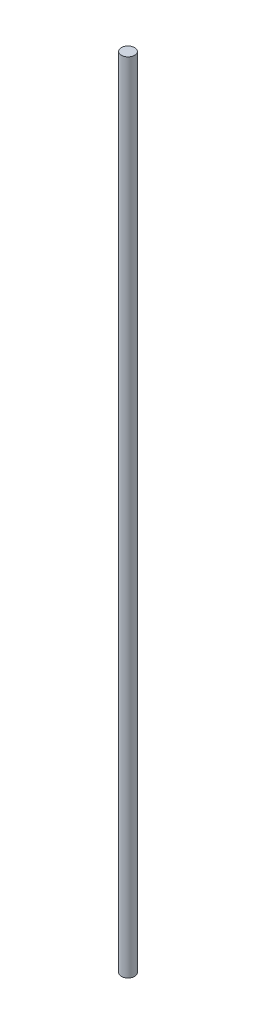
ISO-10303-21;
HEADER;
FILE_DESCRIPTION(('STEP AP214'),'2;1');
FILE_NAME('part.step','',(''),(''),'','','');
FILE_SCHEMA(('AUTOMOTIVE_DESIGN { 1 0 10303 214 1 1 1 1 }'));
ENDSEC;
DATA;
#1=APPLICATION_CONTEXT('core data for automotive mechanical design processes');
#2=APPLICATION_PROTOCOL_DEFINITION('international standard','automotive_design',2000,#1);
#3=PRODUCT_CONTEXT('',#1,'mechanical');
#4=PRODUCT('Part','Part','',(#3));
#5=PRODUCT_RELATED_PRODUCT_CATEGORY('part','',(#4));
#6=PRODUCT_DEFINITION_FORMATION('','',#4);
#7=PRODUCT_DEFINITION_CONTEXT('part definition',#1,'design');
#8=PRODUCT_DEFINITION('design','',#6,#7);
#9=PRODUCT_DEFINITION_SHAPE('','',#8);
#10=(LENGTH_UNIT() NAMED_UNIT(*) SI_UNIT(.MILLI.,.METRE.));
#11=(NAMED_UNIT(*) PLANE_ANGLE_UNIT() SI_UNIT($,.RADIAN.));
#12=(NAMED_UNIT(*) SI_UNIT($,.STERADIAN.) SOLID_ANGLE_UNIT());
#13=UNCERTAINTY_MEASURE_WITH_UNIT(LENGTH_MEASURE(1.E-05),#10,'distance_accuracy_value','');
#14=(GEOMETRIC_REPRESENTATION_CONTEXT(3) GLOBAL_UNCERTAINTY_ASSIGNED_CONTEXT((#13)) GLOBAL_UNIT_ASSIGNED_CONTEXT((#10,
#11,#12)) REPRESENTATION_CONTEXT('',''));
#15=CARTESIAN_POINT('',(0.,0.,0.));
#16=DIRECTION('',(0.,0.,1.));
#17=DIRECTION('',(1.,0.,0.));
#18=AXIS2_PLACEMENT_3D('',#15,#16,#17);
#19=CARTESIAN_POINT('',(0.,1524.,0.));
#20=DIRECTION('',(0.,-1.,0.));
#21=DIRECTION('',(0.,0.,-1.));
#22=AXIS2_PLACEMENT_3D('',#19,#20,#21);
#23=CYLINDRICAL_SURFACE('',#22,12.7);
#24=CARTESIAN_POINT('',(0.,1524.,0.));
#25=DIRECTION('',(0.,1.,0.));
#26=DIRECTION('',(0.,0.,1.));
#27=AXIS2_PLACEMENT_3D('',#24,#25,#26);
#28=CIRCLE('',#27,12.7);
#29=CARTESIAN_POINT('',(0.,1524.,12.7));
#30=VERTEX_POINT('',#29);
#31=EDGE_CURVE('E10',#30,#30,#28,.T.);
#32=ORIENTED_EDGE('',*,*,#31,.F.);
#33=EDGE_LOOP('',(#32));
#34=FACE_BOUND('',#33,.T.);
#35=CARTESIAN_POINT('',(0.,0.,0.));
#36=DIRECTION('',(0.,1.,0.));
#37=DIRECTION('',(0.,0.,1.));
#38=AXIS2_PLACEMENT_3D('',#35,#36,#37);
#39=CIRCLE('',#38,12.7);
#40=CARTESIAN_POINT('',(0.,0.,12.7));
#41=VERTEX_POINT('',#40);
#42=EDGE_CURVE('E36',#41,#41,#39,.T.);
#43=ORIENTED_EDGE('',*,*,#42,.T.);
#44=EDGE_LOOP('',(#43));
#45=FACE_BOUND('',#44,.T.);
#46=ADVANCED_FACE('F30',(#34,#45),#23,.T.);
#47=CARTESIAN_POINT('',(0.,1524.,0.));
#48=DIRECTION('',(0.,1.,0.));
#49=DIRECTION('',(0.,0.,1.));
#50=AXIS2_PLACEMENT_3D('',#47,#48,#49);
#51=PLANE('',#50);
#52=ORIENTED_EDGE('',*,*,#31,.T.);
#53=EDGE_LOOP('',(#52));
#54=FACE_BOUND('',#53,.T.);
#55=ADVANCED_FACE('F45',(#54),#51,.T.);
#56=CARTESIAN_POINT('',(0.,0.,0.));
#57=DIRECTION('',(0.,1.,0.));
#58=DIRECTION('',(0.,0.,1.));
#59=AXIS2_PLACEMENT_3D('',#56,#57,#58);
#60=PLANE('',#59);
#61=ORIENTED_EDGE('',*,*,#42,.F.);
#62=EDGE_LOOP('',(#61));
#63=FACE_BOUND('',#62,.T.);
#64=ADVANCED_FACE('F43',(#63),#60,.F.);
#65=CLOSED_SHELL('',(#46,#55,#64));
#66=MANIFOLD_SOLID_BREP('B2',#65);
#67=ADVANCED_BREP_SHAPE_REPRESENTATION('',(#18,#66),#14);
#68=SHAPE_DEFINITION_REPRESENTATION(#9,#67);
ENDSEC;
END-ISO-10303-21;
